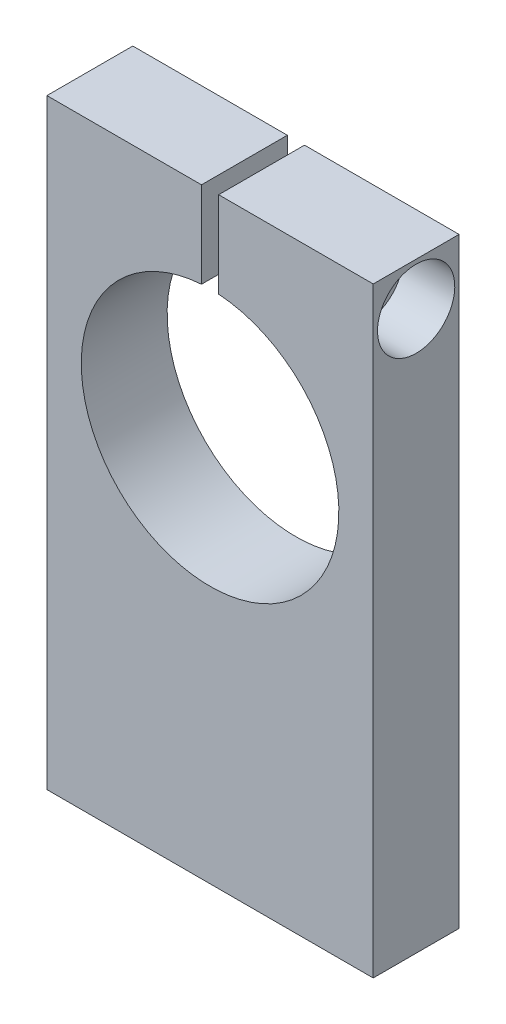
ISO-10303-21;
HEADER;
FILE_DESCRIPTION(('STEP AP214'),'2;1');
FILE_NAME('part.step','',(''),(''),'','','');
FILE_SCHEMA(('AUTOMOTIVE_DESIGN { 1 0 10303 214 1 1 1 1 }'));
ENDSEC;
DATA;
#1=APPLICATION_CONTEXT('core data for automotive mechanical design processes');
#2=APPLICATION_PROTOCOL_DEFINITION('international standard','automotive_design',2000,#1);
#3=PRODUCT_CONTEXT('',#1,'mechanical');
#4=PRODUCT('Part','Part','',(#3));
#5=PRODUCT_RELATED_PRODUCT_CATEGORY('part','',(#4));
#6=PRODUCT_DEFINITION_FORMATION('','',#4);
#7=PRODUCT_DEFINITION_CONTEXT('part definition',#1,'design');
#8=PRODUCT_DEFINITION('design','',#6,#7);
#9=PRODUCT_DEFINITION_SHAPE('','',#8);
#10=(LENGTH_UNIT() NAMED_UNIT(*) SI_UNIT(.MILLI.,.METRE.));
#11=(NAMED_UNIT(*) PLANE_ANGLE_UNIT() SI_UNIT($,.RADIAN.));
#12=(NAMED_UNIT(*) SI_UNIT($,.STERADIAN.) SOLID_ANGLE_UNIT());
#13=UNCERTAINTY_MEASURE_WITH_UNIT(LENGTH_MEASURE(1.E-05),#10,'distance_accuracy_value','');
#14=(GEOMETRIC_REPRESENTATION_CONTEXT(3) GLOBAL_UNCERTAINTY_ASSIGNED_CONTEXT((#13)) GLOBAL_UNIT_ASSIGNED_CONTEXT((#10,
#11,#12)) REPRESENTATION_CONTEXT('',''));
#15=CARTESIAN_POINT('',(0.,0.,0.));
#16=DIRECTION('',(0.,0.,1.));
#17=DIRECTION('',(1.,0.,0.));
#18=AXIS2_PLACEMENT_3D('',#15,#16,#17);
#19=CARTESIAN_POINT('',(-19.,25.,10.));
#20=DIRECTION('',(1.,0.,0.));
#21=DIRECTION('',(0.,1.,0.));
#22=AXIS2_PLACEMENT_3D('',#19,#20,#21);
#23=PLANE('',#22);
#24=CARTESIAN_POINT('',(-19.,20.,5.));
#25=DIRECTION('',(1.,0.,0.));
#26=DIRECTION('',(0.,0.,-1.));
#27=AXIS2_PLACEMENT_3D('',#24,#25,#26);
#28=CIRCLE('',#27,2.1);
#29=CARTESIAN_POINT('',(-19.,20.,2.9));
#30=VERTEX_POINT('',#29);
#31=EDGE_CURVE('E145',#30,#30,#28,.T.);
#32=ORIENTED_EDGE('',*,*,#31,.T.);
#33=EDGE_LOOP('',(#32));
#34=FACE_BOUND('',#33,.T.);
#35=DIRECTION('',(0.,-1.,0.));
#36=VECTOR('',#35,1.);
#37=CARTESIAN_POINT('',(-19.,25.,0.));
#38=LINE('',#37,#36);
#39=CARTESIAN_POINT('',(-19.,25.,0.));
#40=VERTEX_POINT('',#39);
#41=CARTESIAN_POINT('',(-19.,-45.,0.));
#42=VERTEX_POINT('',#41);
#43=EDGE_CURVE('E151',#40,#42,#38,.T.);
#44=ORIENTED_EDGE('',*,*,#43,.T.);
#45=DIRECTION('',(0.,0.,-1.));
#46=VECTOR('',#45,1.);
#47=CARTESIAN_POINT('',(-19.,-45.,10.));
#48=LINE('',#47,#46);
#49=CARTESIAN_POINT('',(-19.,-45.,10.));
#50=VERTEX_POINT('',#49);
#51=EDGE_CURVE('E13',#50,#42,#48,.T.);
#52=ORIENTED_EDGE('',*,*,#51,.F.);
#53=DIRECTION('',(0.,-1.,0.));
#54=VECTOR('',#53,1.);
#55=CARTESIAN_POINT('',(-19.,25.,10.));
#56=LINE('',#55,#54);
#57=CARTESIAN_POINT('',(-19.,25.,10.));
#58=VERTEX_POINT('',#57);
#59=EDGE_CURVE('E168',#58,#50,#56,.T.);
#60=ORIENTED_EDGE('',*,*,#59,.F.);
#61=DIRECTION('',(0.,0.,-1.));
#62=VECTOR('',#61,1.);
#63=CARTESIAN_POINT('',(-19.,25.,10.));
#64=LINE('',#63,#62);
#65=EDGE_CURVE('E182',#58,#40,#64,.T.);
#66=ORIENTED_EDGE('',*,*,#65,.T.);
#67=EDGE_LOOP('',(#44,#52,#60,#66));
#68=FACE_BOUND('',#67,.T.);
#69=ADVANCED_FACE('F45',(#34,#68),#23,.F.);
#70=CARTESIAN_POINT('',(-19.,-45.,10.));
#71=DIRECTION('',(0.,1.,0.));
#72=DIRECTION('',(0.,0.,1.));
#73=AXIS2_PLACEMENT_3D('',#70,#71,#72);
#74=PLANE('',#73);
#75=CARTESIAN_POINT('',(-13.,-45.,5.));
#76=DIRECTION('',(0.,-1.,0.));
#77=DIRECTION('',(0.,0.,-1.));
#78=AXIS2_PLACEMENT_3D('',#75,#76,#77);
#79=CIRCLE('',#78,2.09999999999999);
#80=CARTESIAN_POINT('',(-13.,-45.,2.90000000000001));
#81=VERTEX_POINT('',#80);
#82=EDGE_CURVE('E122',#81,#81,#79,.T.);
#83=ORIENTED_EDGE('',*,*,#82,.F.);
#84=EDGE_LOOP('',(#83));
#85=FACE_BOUND('',#84,.T.);
#86=CARTESIAN_POINT('',(13.,-45.,5.));
#87=DIRECTION('',(0.,-1.,0.));
#88=DIRECTION('',(0.,0.,-1.));
#89=AXIS2_PLACEMENT_3D('',#86,#87,#88);
#90=CIRCLE('',#89,2.09999999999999);
#91=CARTESIAN_POINT('',(13.,-45.,2.90000000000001));
#92=VERTEX_POINT('',#91);
#93=EDGE_CURVE('E130',#92,#92,#90,.T.);
#94=ORIENTED_EDGE('',*,*,#93,.F.);
#95=EDGE_LOOP('',(#94));
#96=FACE_BOUND('',#95,.T.);
#97=DIRECTION('',(1.,0.,0.));
#98=VECTOR('',#97,1.);
#99=CARTESIAN_POINT('',(-19.,-45.,0.));
#100=LINE('',#99,#98);
#101=CARTESIAN_POINT('',(19.,-45.,0.));
#102=VERTEX_POINT('',#101);
#103=EDGE_CURVE('E154',#42,#102,#100,.T.);
#104=ORIENTED_EDGE('',*,*,#103,.T.);
#105=DIRECTION('',(0.,0.,-1.));
#106=VECTOR('',#105,1.);
#107=CARTESIAN_POINT('',(19.,-45.,10.));
#108=LINE('',#107,#106);
#109=CARTESIAN_POINT('',(19.,-45.,10.));
#110=VERTEX_POINT('',#109);
#111=EDGE_CURVE('E52',#110,#102,#108,.T.);
#112=ORIENTED_EDGE('',*,*,#111,.F.);
#113=DIRECTION('',(1.,0.,0.));
#114=VECTOR('',#113,1.);
#115=CARTESIAN_POINT('',(-19.,-45.,10.));
#116=LINE('',#115,#114);
#117=EDGE_CURVE('E170',#50,#110,#116,.T.);
#118=ORIENTED_EDGE('',*,*,#117,.F.);
#119=ORIENTED_EDGE('',*,*,#51,.T.);
#120=EDGE_LOOP('',(#104,#112,#118,#119));
#121=FACE_BOUND('',#120,.T.);
#122=ADVANCED_FACE('F226',(#85,#96,#121),#74,.F.);
#123=CARTESIAN_POINT('',(19.,25.,10.));
#124=DIRECTION('',(-1.,0.,0.));
#125=DIRECTION('',(0.,-1.,0.));
#126=AXIS2_PLACEMENT_3D('',#123,#124,#125);
#127=PLANE('',#126);
#128=CARTESIAN_POINT('',(19.,20.,5.));
#129=DIRECTION('',(1.,0.,0.));
#130=DIRECTION('',(0.,1.,0.));
#131=AXIS2_PLACEMENT_3D('',#128,#129,#130);
#132=CIRCLE('',#131,4.5);
#133=CARTESIAN_POINT('',(19.,24.5,5.));
#134=VERTEX_POINT('',#133);
#135=EDGE_CURVE('E139',#134,#134,#132,.T.);
#136=ORIENTED_EDGE('',*,*,#135,.F.);
#137=EDGE_LOOP('',(#136));
#138=FACE_BOUND('',#137,.T.);
#139=DIRECTION('',(0.,1.,0.));
#140=VECTOR('',#139,1.);
#141=CARTESIAN_POINT('',(19.,25.,0.));
#142=LINE('',#141,#140);
#143=CARTESIAN_POINT('',(19.,25.,0.));
#144=VERTEX_POINT('',#143);
#145=EDGE_CURVE('E156',#102,#144,#142,.T.);
#146=ORIENTED_EDGE('',*,*,#145,.T.);
#147=DIRECTION('',(0.,0.,-1.));
#148=VECTOR('',#147,1.);
#149=CARTESIAN_POINT('',(19.,25.,10.));
#150=LINE('',#149,#148);
#151=CARTESIAN_POINT('',(19.,25.,10.));
#152=VERTEX_POINT('',#151);
#153=EDGE_CURVE('E197',#152,#144,#150,.T.);
#154=ORIENTED_EDGE('',*,*,#153,.F.);
#155=DIRECTION('',(0.,1.,0.));
#156=VECTOR('',#155,1.);
#157=CARTESIAN_POINT('',(19.,25.,10.));
#158=LINE('',#157,#156);
#159=EDGE_CURVE('E172',#110,#152,#158,.T.);
#160=ORIENTED_EDGE('',*,*,#159,.F.);
#161=ORIENTED_EDGE('',*,*,#111,.T.);
#162=EDGE_LOOP('',(#146,#154,#160,#161));
#163=FACE_BOUND('',#162,.T.);
#164=ADVANCED_FACE('F204',(#138,#163),#127,.F.);
#165=CARTESIAN_POINT('',(0.999999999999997,25.,10.));
#166=DIRECTION('',(0.,-1.,0.));
#167=DIRECTION('',(0.,0.,-1.));
#168=AXIS2_PLACEMENT_3D('',#165,#166,#167);
#169=PLANE('',#168);
#170=DIRECTION('',(-1.,0.,0.));
#171=VECTOR('',#170,1.);
#172=CARTESIAN_POINT('',(0.999999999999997,25.,0.));
#173=LINE('',#172,#171);
#174=CARTESIAN_POINT('',(0.999999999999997,25.,0.));
#175=VERTEX_POINT('',#174);
#176=EDGE_CURVE('E158',#144,#175,#173,.T.);
#177=ORIENTED_EDGE('',*,*,#176,.T.);
#178=DIRECTION('',(0.,0.,-1.));
#179=VECTOR('',#178,1.);
#180=CARTESIAN_POINT('',(0.999999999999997,25.,10.));
#181=LINE('',#180,#179);
#182=CARTESIAN_POINT('',(0.999999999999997,25.,10.));
#183=VERTEX_POINT('',#182);
#184=EDGE_CURVE('E194',#183,#175,#181,.T.);
#185=ORIENTED_EDGE('',*,*,#184,.F.);
#186=DIRECTION('',(-1.,0.,0.));
#187=VECTOR('',#186,1.);
#188=CARTESIAN_POINT('',(0.999999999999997,25.,10.));
#189=LINE('',#188,#187);
#190=EDGE_CURVE('E174',#152,#183,#189,.T.);
#191=ORIENTED_EDGE('',*,*,#190,.F.);
#192=ORIENTED_EDGE('',*,*,#153,.T.);
#193=EDGE_LOOP('',(#177,#185,#191,#192));
#194=FACE_BOUND('',#193,.T.);
#195=ADVANCED_FACE('F215',(#194),#169,.F.);
#196=CARTESIAN_POINT('',(0.999999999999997,25.,10.));
#197=DIRECTION('',(1.,0.,0.));
#198=DIRECTION('',(0.,1.,0.));
#199=AXIS2_PLACEMENT_3D('',#196,#197,#198);
#200=PLANE('',#199);
#201=CARTESIAN_POINT('',(0.999999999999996,20.,5.));
#202=DIRECTION('',(1.,0.,0.));
#203=DIRECTION('',(0.,1.,0.));
#204=AXIS2_PLACEMENT_3D('',#201,#202,#203);
#205=CIRCLE('',#204,2.75);
#206=CARTESIAN_POINT('',(0.999999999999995,22.75,5.));
#207=VERTEX_POINT('',#206);
#208=EDGE_CURVE('E136',#207,#207,#205,.T.);
#209=ORIENTED_EDGE('',*,*,#208,.T.);
#210=EDGE_LOOP('',(#209));
#211=FACE_BOUND('',#210,.T.);
#212=DIRECTION('',(0.,-1.,0.));
#213=VECTOR('',#212,1.);
#214=CARTESIAN_POINT('',(0.999999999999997,25.,0.));
#215=LINE('',#214,#213);
#216=CARTESIAN_POINT('',(0.999999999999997,14.9666295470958,0.));
#217=VERTEX_POINT('',#216);
#218=EDGE_CURVE('E160',#175,#217,#215,.T.);
#219=ORIENTED_EDGE('',*,*,#218,.T.);
#220=DIRECTION('',(0.,0.,-1.));
#221=VECTOR('',#220,1.);
#222=CARTESIAN_POINT('',(0.999999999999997,14.9666295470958,10.));
#223=LINE('',#222,#221);
#224=CARTESIAN_POINT('',(0.999999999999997,14.9666295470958,10.));
#225=VERTEX_POINT('',#224);
#226=EDGE_CURVE('E191',#225,#217,#223,.T.);
#227=ORIENTED_EDGE('',*,*,#226,.F.);
#228=DIRECTION('',(0.,-1.,0.));
#229=VECTOR('',#228,1.);
#230=CARTESIAN_POINT('',(0.999999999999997,25.,10.));
#231=LINE('',#230,#229);
#232=EDGE_CURVE('E176',#183,#225,#231,.T.);
#233=ORIENTED_EDGE('',*,*,#232,.F.);
#234=ORIENTED_EDGE('',*,*,#184,.T.);
#235=EDGE_LOOP('',(#219,#227,#233,#234));
#236=FACE_BOUND('',#235,.T.);
#237=ADVANCED_FACE('F219',(#211,#236),#200,.F.);
#238=CARTESIAN_POINT('',(0.,0.,10.));
#239=DIRECTION('',(0.,0.,-1.));
#240=DIRECTION('',(-1.,0.,0.));
#241=AXIS2_PLACEMENT_3D('',#238,#239,#240);
#242=CYLINDRICAL_SURFACE('',#241,15.);
#243=CARTESIAN_POINT('',(0.,0.,0.));
#244=DIRECTION('',(0.,0.,-1.));
#245=DIRECTION('',(1.,0.,0.));
#246=AXIS2_PLACEMENT_3D('',#243,#244,#245);
#247=CIRCLE('',#246,15.);
#248=CARTESIAN_POINT('',(-1.,14.9666295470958,0.));
#249=VERTEX_POINT('',#248);
#250=EDGE_CURVE('E162',#217,#249,#247,.T.);
#251=ORIENTED_EDGE('',*,*,#250,.T.);
#252=DIRECTION('',(0.,0.,-1.));
#253=VECTOR('',#252,1.);
#254=CARTESIAN_POINT('',(-1.,14.9666295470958,10.));
#255=LINE('',#254,#253);
#256=CARTESIAN_POINT('',(-1.,14.9666295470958,10.));
#257=VERTEX_POINT('',#256);
#258=EDGE_CURVE('E188',#257,#249,#255,.T.);
#259=ORIENTED_EDGE('',*,*,#258,.F.);
#260=CARTESIAN_POINT('',(0.,0.,10.));
#261=DIRECTION('',(0.,0.,-1.));
#262=DIRECTION('',(1.,0.,0.));
#263=AXIS2_PLACEMENT_3D('',#260,#261,#262);
#264=CIRCLE('',#263,15.);
#265=EDGE_CURVE('E178',#225,#257,#264,.T.);
#266=ORIENTED_EDGE('',*,*,#265,.F.);
#267=ORIENTED_EDGE('',*,*,#226,.T.);
#268=EDGE_LOOP('',(#251,#259,#266,#267));
#269=FACE_BOUND('',#268,.T.);
#270=ADVANCED_FACE('F235',(#269),#242,.F.);
#271=CARTESIAN_POINT('',(-1.,25.,10.));
#272=DIRECTION('',(-1.,0.,0.));
#273=DIRECTION('',(0.,-1.,0.));
#274=AXIS2_PLACEMENT_3D('',#271,#272,#273);
#275=PLANE('',#274);
#276=CARTESIAN_POINT('',(-1.,20.,5.));
#277=DIRECTION('',(1.,0.,0.));
#278=DIRECTION('',(0.,0.,-1.));
#279=AXIS2_PLACEMENT_3D('',#276,#277,#278);
#280=CIRCLE('',#279,2.09999999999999);
#281=CARTESIAN_POINT('',(-1.,20.,2.90000000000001));
#282=VERTEX_POINT('',#281);
#283=EDGE_CURVE('E148',#282,#282,#280,.T.);
#284=ORIENTED_EDGE('',*,*,#283,.F.);
#285=EDGE_LOOP('',(#284));
#286=FACE_BOUND('',#285,.T.);
#287=DIRECTION('',(0.,1.,0.));
#288=VECTOR('',#287,1.);
#289=CARTESIAN_POINT('',(-1.,25.,0.));
#290=LINE('',#289,#288);
#291=CARTESIAN_POINT('',(-1.,25.,0.));
#292=VERTEX_POINT('',#291);
#293=EDGE_CURVE('E164',#249,#292,#290,.T.);
#294=ORIENTED_EDGE('',*,*,#293,.T.);
#295=DIRECTION('',(0.,0.,-1.));
#296=VECTOR('',#295,1.);
#297=CARTESIAN_POINT('',(-1.,25.,10.));
#298=LINE('',#297,#296);
#299=CARTESIAN_POINT('',(-1.,25.,10.));
#300=VERTEX_POINT('',#299);
#301=EDGE_CURVE('E185',#300,#292,#298,.T.);
#302=ORIENTED_EDGE('',*,*,#301,.F.);
#303=DIRECTION('',(0.,1.,0.));
#304=VECTOR('',#303,1.);
#305=CARTESIAN_POINT('',(-1.,25.,10.));
#306=LINE('',#305,#304);
#307=EDGE_CURVE('E64',#257,#300,#306,.T.);
#308=ORIENTED_EDGE('',*,*,#307,.F.);
#309=ORIENTED_EDGE('',*,*,#258,.T.);
#310=EDGE_LOOP('',(#294,#302,#308,#309));
#311=FACE_BOUND('',#310,.T.);
#312=ADVANCED_FACE('F233',(#286,#311),#275,.F.);
#313=CARTESIAN_POINT('',(-19.,25.,10.));
#314=DIRECTION('',(0.,-1.,0.));
#315=DIRECTION('',(0.,0.,-1.));
#316=AXIS2_PLACEMENT_3D('',#313,#314,#315);
#317=PLANE('',#316);
#318=DIRECTION('',(-1.,0.,0.));
#319=VECTOR('',#318,1.);
#320=CARTESIAN_POINT('',(-19.,25.,0.));
#321=LINE('',#320,#319);
#322=EDGE_CURVE('E166',#292,#40,#321,.T.);
#323=ORIENTED_EDGE('',*,*,#322,.T.);
#324=ORIENTED_EDGE('',*,*,#65,.F.);
#325=DIRECTION('',(-1.,0.,0.));
#326=VECTOR('',#325,1.);
#327=CARTESIAN_POINT('',(-19.,25.,10.));
#328=LINE('',#327,#326);
#329=EDGE_CURVE('E59',#300,#58,#328,.T.);
#330=ORIENTED_EDGE('',*,*,#329,.F.);
#331=ORIENTED_EDGE('',*,*,#301,.T.);
#332=EDGE_LOOP('',(#323,#324,#330,#331));
#333=FACE_BOUND('',#332,.T.);
#334=ADVANCED_FACE('F231',(#333),#317,.F.);
#335=CARTESIAN_POINT('',(0.,0.,10.));
#336=DIRECTION('',(0.,0.,1.));
#337=DIRECTION('',(1.,0.,0.));
#338=AXIS2_PLACEMENT_3D('',#335,#336,#337);
#339=PLANE('',#338);
#340=ORIENTED_EDGE('',*,*,#59,.T.);
#341=ORIENTED_EDGE('',*,*,#117,.T.);
#342=ORIENTED_EDGE('',*,*,#159,.T.);
#343=ORIENTED_EDGE('',*,*,#190,.T.);
#344=ORIENTED_EDGE('',*,*,#232,.T.);
#345=ORIENTED_EDGE('',*,*,#265,.T.);
#346=ORIENTED_EDGE('',*,*,#307,.T.);
#347=ORIENTED_EDGE('',*,*,#329,.T.);
#348=EDGE_LOOP('',(#340,#341,#342,#343,#344,#345,#346,#347));
#349=FACE_BOUND('',#348,.T.);
#350=ADVANCED_FACE('F222',(#349),#339,.T.);
#351=CARTESIAN_POINT('',(0.,0.,0.));
#352=DIRECTION('',(0.,0.,1.));
#353=DIRECTION('',(1.,0.,0.));
#354=AXIS2_PLACEMENT_3D('',#351,#352,#353);
#355=PLANE('',#354);
#356=ORIENTED_EDGE('',*,*,#43,.F.);
#357=ORIENTED_EDGE('',*,*,#322,.F.);
#358=ORIENTED_EDGE('',*,*,#293,.F.);
#359=ORIENTED_EDGE('',*,*,#250,.F.);
#360=ORIENTED_EDGE('',*,*,#218,.F.);
#361=ORIENTED_EDGE('',*,*,#176,.F.);
#362=ORIENTED_EDGE('',*,*,#145,.F.);
#363=ORIENTED_EDGE('',*,*,#103,.F.);
#364=EDGE_LOOP('',(#356,#357,#358,#359,#360,#361,#362,#363));
#365=FACE_BOUND('',#364,.T.);
#366=ADVANCED_FACE('F210',(#365),#355,.F.);
#367=CARTESIAN_POINT('',(-1.,20.,5.));
#368=DIRECTION('',(1.,0.,0.));
#369=DIRECTION('',(0.,0.,-1.));
#370=AXIS2_PLACEMENT_3D('',#367,#368,#369);
#371=CYLINDRICAL_SURFACE('',#370,2.09999999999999);
#372=ORIENTED_EDGE('',*,*,#31,.F.);
#373=EDGE_LOOP('',(#372));
#374=FACE_BOUND('',#373,.T.);
#375=ORIENTED_EDGE('',*,*,#283,.T.);
#376=EDGE_LOOP('',(#375));
#377=FACE_BOUND('',#376,.T.);
#378=ADVANCED_FACE('F254',(#374,#377),#371,.F.);
#379=CARTESIAN_POINT('',(13.,20.,5.));
#380=DIRECTION('',(1.,0.,0.));
#381=DIRECTION('',(0.,1.,0.));
#382=AXIS2_PLACEMENT_3D('',#379,#380,#381);
#383=CYLINDRICAL_SURFACE('',#382,4.5);
#384=CARTESIAN_POINT('',(13.,20.,5.));
#385=DIRECTION('',(1.,0.,0.));
#386=DIRECTION('',(0.,1.,0.));
#387=AXIS2_PLACEMENT_3D('',#384,#385,#386);
#388=CIRCLE('',#387,4.5);
#389=CARTESIAN_POINT('',(13.,24.5,5.));
#390=VERTEX_POINT('',#389);
#391=EDGE_CURVE('E142',#390,#390,#388,.T.);
#392=ORIENTED_EDGE('',*,*,#391,.F.);
#393=EDGE_LOOP('',(#392));
#394=FACE_BOUND('',#393,.T.);
#395=ORIENTED_EDGE('',*,*,#135,.T.);
#396=EDGE_LOOP('',(#395));
#397=FACE_BOUND('',#396,.T.);
#398=ADVANCED_FACE('F257',(#394,#397),#383,.F.);
#399=CARTESIAN_POINT('',(13.,20.,5.));
#400=DIRECTION('',(1.,0.,0.));
#401=DIRECTION('',(0.,1.,0.));
#402=AXIS2_PLACEMENT_3D('',#399,#400,#401);
#403=PLANE('',#402);
#404=CARTESIAN_POINT('',(13.,20.,5.));
#405=DIRECTION('',(1.,0.,0.));
#406=DIRECTION('',(0.,1.,0.));
#407=AXIS2_PLACEMENT_3D('',#404,#405,#406);
#408=CIRCLE('',#407,2.75);
#409=CARTESIAN_POINT('',(13.,22.75,5.));
#410=VERTEX_POINT('',#409);
#411=EDGE_CURVE('E133',#410,#410,#408,.T.);
#412=ORIENTED_EDGE('',*,*,#411,.F.);
#413=EDGE_LOOP('',(#412));
#414=FACE_BOUND('',#413,.T.);
#415=ORIENTED_EDGE('',*,*,#391,.T.);
#416=EDGE_LOOP('',(#415));
#417=FACE_BOUND('',#416,.T.);
#418=ADVANCED_FACE('F264',(#414,#417),#403,.T.);
#419=CARTESIAN_POINT('',(0.999999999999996,20.,5.));
#420=DIRECTION('',(1.,0.,0.));
#421=DIRECTION('',(0.,1.,0.));
#422=AXIS2_PLACEMENT_3D('',#419,#420,#421);
#423=CYLINDRICAL_SURFACE('',#422,2.75);
#424=ORIENTED_EDGE('',*,*,#208,.F.);
#425=EDGE_LOOP('',(#424));
#426=FACE_BOUND('',#425,.T.);
#427=ORIENTED_EDGE('',*,*,#411,.T.);
#428=EDGE_LOOP('',(#427));
#429=FACE_BOUND('',#428,.T.);
#430=ADVANCED_FACE('F331',(#426,#429),#423,.F.);
#431=CARTESIAN_POINT('',(13.,-45.,5.));
#432=DIRECTION('',(0.,-1.,0.));
#433=DIRECTION('',(0.,0.,-1.));
#434=AXIS2_PLACEMENT_3D('',#431,#432,#433);
#435=CYLINDRICAL_SURFACE('',#434,2.09999999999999);
#436=CARTESIAN_POINT('',(13.,-26.,5.));
#437=DIRECTION('',(0.,-1.,0.));
#438=DIRECTION('',(0.,0.,-1.));
#439=AXIS2_PLACEMENT_3D('',#436,#437,#438);
#440=CIRCLE('',#439,2.1);
#441=CARTESIAN_POINT('',(13.,-26.,2.9));
#442=VERTEX_POINT('',#441);
#443=EDGE_CURVE('E125',#442,#442,#440,.T.);
#444=ORIENTED_EDGE('',*,*,#443,.F.);
#445=EDGE_LOOP('',(#444));
#446=FACE_BOUND('',#445,.T.);
#447=ORIENTED_EDGE('',*,*,#93,.T.);
#448=EDGE_LOOP('',(#447));
#449=FACE_BOUND('',#448,.T.);
#450=ADVANCED_FACE('F340',(#446,#449),#435,.F.);
#451=CARTESIAN_POINT('',(13.,-26.,5.));
#452=DIRECTION('',(0.,-1.,0.));
#453=DIRECTION('',(0.,0.,-1.));
#454=AXIS2_PLACEMENT_3D('',#451,#452,#453);
#455=CONICAL_SURFACE('',#454,2.1,1.02974425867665);
#456=CARTESIAN_POINT('',(13.,-24.7381927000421,5.));
#457=VERTEX_POINT('',#456);
#458=VERTEX_LOOP('',#457);
#459=FACE_BOUND('',#458,.T.);
#460=ORIENTED_EDGE('',*,*,#443,.T.);
#461=EDGE_LOOP('',(#460));
#462=FACE_BOUND('',#461,.T.);
#463=ADVANCED_FACE('F356',(#459,#462),#455,.F.);
#464=CARTESIAN_POINT('',(-13.,-45.,5.));
#465=DIRECTION('',(0.,-1.,0.));
#466=DIRECTION('',(0.,0.,-1.));
#467=AXIS2_PLACEMENT_3D('',#464,#465,#466);
#468=CYLINDRICAL_SURFACE('',#467,2.09999999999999);
#469=CARTESIAN_POINT('',(-13.,-26.,5.));
#470=DIRECTION('',(0.,-1.,0.));
#471=DIRECTION('',(0.,0.,-1.));
#472=AXIS2_PLACEMENT_3D('',#469,#470,#471);
#473=CIRCLE('',#472,2.1);
#474=CARTESIAN_POINT('',(-13.,-26.,2.9));
#475=VERTEX_POINT('',#474);
#476=EDGE_CURVE('E120',#475,#475,#473,.T.);
#477=ORIENTED_EDGE('',*,*,#476,.F.);
#478=EDGE_LOOP('',(#477));
#479=FACE_BOUND('',#478,.T.);
#480=ORIENTED_EDGE('',*,*,#82,.T.);
#481=EDGE_LOOP('',(#480));
#482=FACE_BOUND('',#481,.T.);
#483=ADVANCED_FACE('F116',(#479,#482),#468,.F.);
#484=CARTESIAN_POINT('',(-13.,-26.,5.));
#485=DIRECTION('',(0.,-1.,0.));
#486=DIRECTION('',(0.,0.,-1.));
#487=AXIS2_PLACEMENT_3D('',#484,#485,#486);
#488=CONICAL_SURFACE('',#487,2.1,1.02974425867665);
#489=CARTESIAN_POINT('',(-13.,-24.7381927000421,5.));
#490=VERTEX_POINT('',#489);
#491=VERTEX_LOOP('',#490);
#492=FACE_BOUND('',#491,.T.);
#493=ORIENTED_EDGE('',*,*,#476,.T.);
#494=EDGE_LOOP('',(#493));
#495=FACE_BOUND('',#494,.T.);
#496=ADVANCED_FACE('F113',(#492,#495),#488,.F.);
#497=CLOSED_SHELL('',(#69,#122,#164,#195,#237,#270,#312,#334,#350,#366,#378,#398,#418,#430,#450,
#463,#483,#496));
#498=MANIFOLD_SOLID_BREP('B2',#497);
#499=ADVANCED_BREP_SHAPE_REPRESENTATION('',(#18,#498),#14);
#500=SHAPE_DEFINITION_REPRESENTATION(#9,#499);
ENDSEC;
END-ISO-10303-21;
